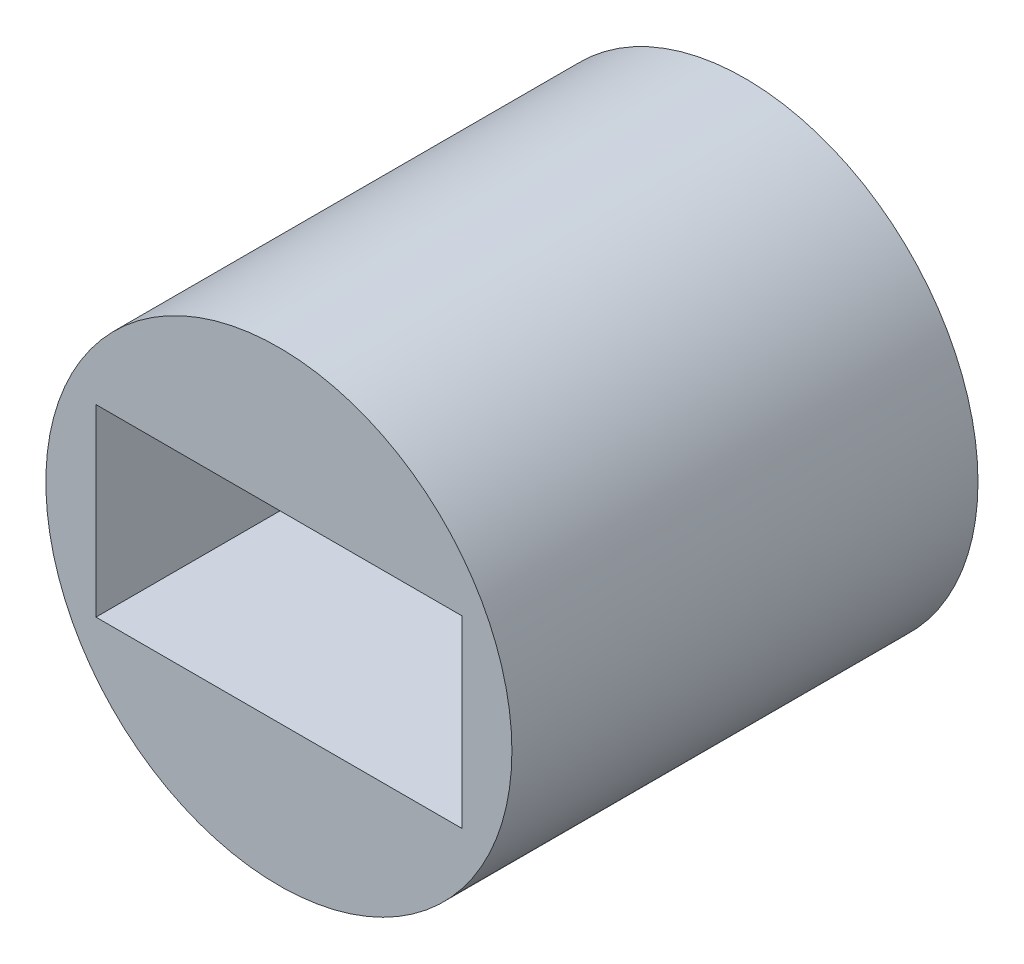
from build123d import *

# Parameters (mm, degrees)
SKETCH2_R           = 25.4
BOSS_EXTRUDE1_DEPTH = 50.8
SKETCH3_W           = 39.878
SKETCH3_H           = 20.066
CUT_EXTRUDE1_DEPTH  = 35.56


with BuildPart() as part:
    # Sketch2 → Boss-Extrude1 (new body)
    with BuildSketch(Plane.XY):
        Circle(SKETCH2_R)
    extrude(amount=BOSS_EXTRUDE1_DEPTH)

    # Sketch3 → Cut-Extrude1 (cut)
    with BuildSketch(Plane.XY.offset(50.8)):
        Rectangle(SKETCH3_W, SKETCH3_H)
    extrude(amount=-CUT_EXTRUDE1_DEPTH, mode=Mode.SUBTRACT)


solid = part.part
